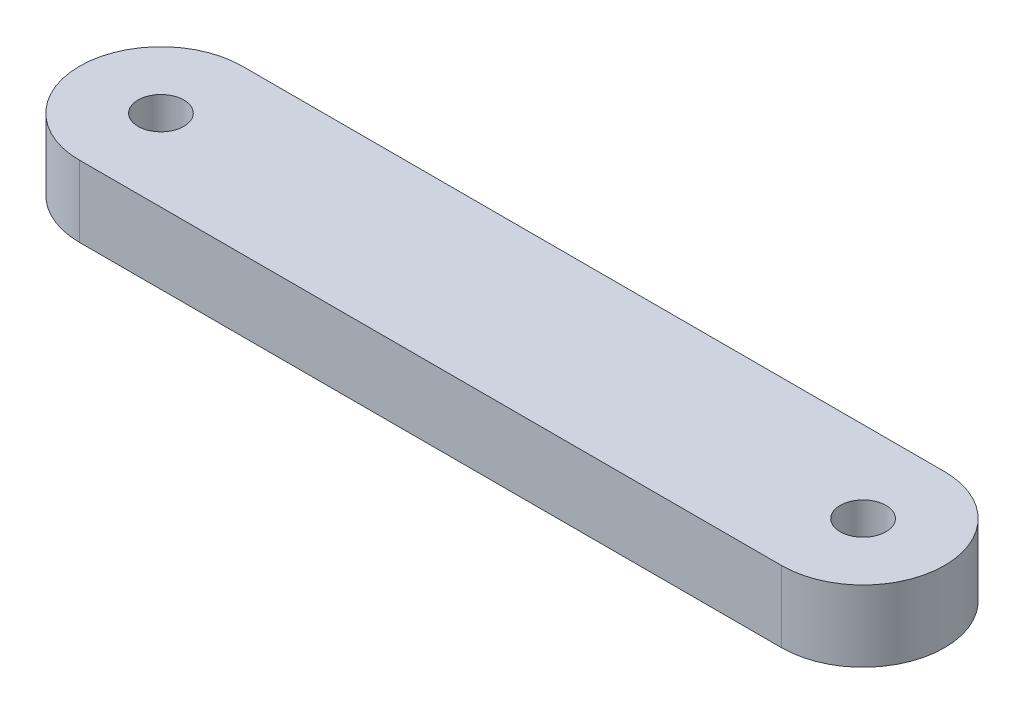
from build123d import *

# Parameters (mm, degrees)
SKETCH1_R           = 5.715
BOSS_EXTRUDE2_DEPTH = 17.78


with BuildPart() as part:
    # Sketch1 → Boss-Extrude2 (new body)
    with BuildSketch(Plane(origin=(0, 0, 0), x_dir=(1, 0, 0), z_dir=(0, 1, 0))):
        with BuildLine():
            Line((-87.63, 20.32), (87.63, 20.32))
            ThreePointArc((87.63, 20.32), (107.95, 0), (87.63, -20.32))
            Line((87.63, -20.32), (-87.63, -20.32))
            ThreePointArc((-87.63, -20.32), (-107.95, 0), (-87.63, 20.32))
        make_face()
        with Locations(Location((87.63, 0, 0), (0, 0, 270))):
            Circle(SKETCH1_R, mode=Mode.SUBTRACT)
        with Locations(Location((-87.63, 0, 0), (0, 0, 270))):
            Circle(SKETCH1_R, mode=Mode.SUBTRACT)
    extrude(amount=BOSS_EXTRUDE2_DEPTH)


solid = part.part
